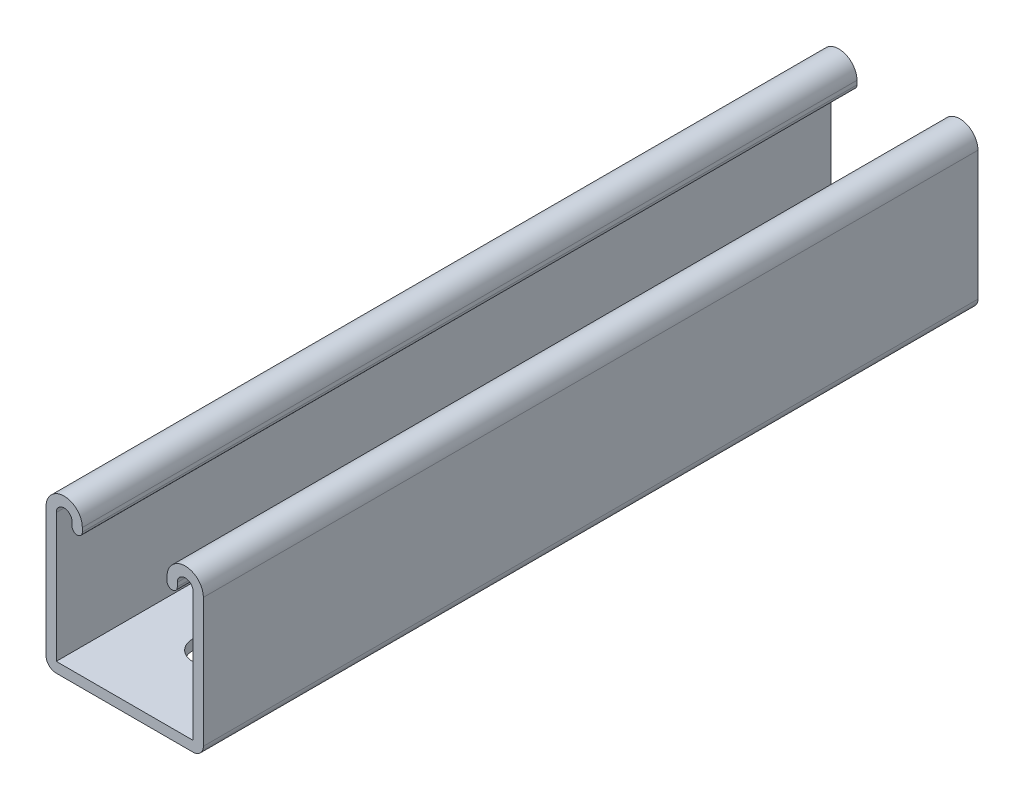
from build123d import *

# Parameters (mm, degrees)
BASE_EXTRUDE_DEPTH = 203.2
LSLOT_DEPTH        = 219.410047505
LPATTERN1_COUNT    = 2
LPATTERN1_PITCH    = 101.6


with BuildPart() as part:
    # Sketch1 → Base-Extrude (new body)
    with BuildSketch(Plane.XY):
        with BuildLine():
            Line((-20.6375, 18.4785), (-20.6375, -15.3416))
            ThreePointArc((-20.6375, -15.3416), (-19.848914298, -17.245414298), (-17.9451, -18.034))
            Line((-17.9451, -18.034), (17.9451, -18.034))
            ThreePointArc((17.9451, -18.034), (19.848914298, -17.245414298), (20.6375, -15.3416))
            Line((20.6375, -15.3416), (20.6375, 18.4785))
            ThreePointArc((20.6375, 18.4785), (15.875, 23.241), (11.1125, 18.4785))
            Line((11.1125, 18.4785), (11.1125, 17.44345))
            ThreePointArc((11.1125, 17.44345), (12.4587, 16.09725), (13.8049, 17.44345))
            Line((13.8049, 17.44345), (13.8049, 18.4785))
            ThreePointArc((13.8049, 18.4785), (15.875, 20.5486), (17.9451, 18.4785))
            Line((17.9451, 18.4785), (17.9451, -15.3416))
            Line((17.9451, -15.3416), (-17.9451, -15.3416))
            Line((-17.9451, -15.3416), (-17.9451, 18.4785))
            ThreePointArc((-17.9451, 18.4785), (-15.875, 20.5486), (-13.8049, 18.4785))
            Line((-13.8049, 18.4785), (-13.8049, 17.44345))
            ThreePointArc((-13.8049, 17.44345), (-12.4587, 16.09725), (-11.1125, 17.44345))
            Line((-11.1125, 17.44345), (-11.1125, 18.4785))
            ThreePointArc((-11.1125, 18.4785), (-15.875, 23.241), (-20.6375, 18.4785))
        make_face()
    extrude(amount=BASE_EXTRUDE_DEPTH)

    # Sketch2 → LSlot (cut, through all)
    with BuildSketch(Plane(origin=(1.308314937, -18.034, -10.148785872), x_dir=(1, 0, 0), z_dir=(0, -1, 0))):
        with BuildLine():
            Line((3.851060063, 88.730035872), (3.851060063, 22.848785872))
            ThreePointArc((3.851060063, 22.848785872), (-1.308314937, 17.689410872), (-6.467689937, 22.848785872))
            Line((-6.467689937, 22.848785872), (-6.467689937, 88.730035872))
            ThreePointArc((-6.467689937, 88.730035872), (-1.308314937, 93.889410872), (3.851060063, 88.730035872))
        make_face()
    lslot = extrude(amount=-LSLOT_DEPTH, mode=Mode.SUBTRACT)

    # LPattern1: LSlot ×2
    with Locations(*[(0, 0, i * LPATTERN1_PITCH) for i in range(1, LPATTERN1_COUNT)]):
        add(lslot, mode=Mode.SUBTRACT)


solid = part.part
